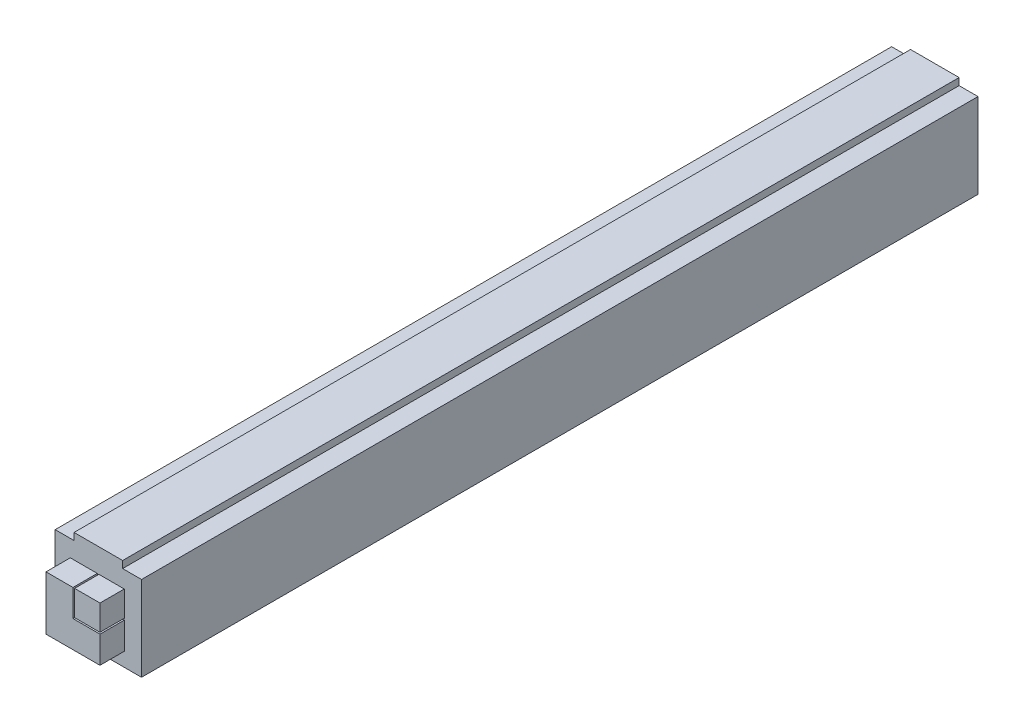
from build123d import *

# Parameters (mm, degrees)
DODANIE_WYCI_GNI_CIE2_START   = -5
DODANIE_WYCI_GNI_CIE2_DEPTH   = 155
DODANIE_WYCI_GNI_CIE3_START   = 0.2
DODANIE_WYCI_GNI_CIE3_DEPTH   = 4.5
SZKIC3_W                      = 4.698607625
SZKIC3_H                      = 4.698607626
DODANIE_WYCI_GNI_CIE3_2_DEPTH = 4.5
SZKIC4_R                      = 6.65
WYTNIJ_WYCI_GNI_CIE1_DEPTH    = 5


with BuildPart() as part:
    # Szkic2 → Dodanie-wyci_gni_cie2 (new body)
    with BuildSketch(Plane.XY.offset(DODANIE_WYCI_GNI_CIE2_START)):
        Polygon((4.5, 29.760650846), (4.5, 28.460650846), (8, 28.460650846), (8, 12.760650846), (-8, 12.760650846), (-8, 28.460650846), (-4.5, 28.460650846), (-4.5, 29.760650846), align=None)
    extrude(amount=-DODANIE_WYCI_GNI_CIE2_DEPTH)

    # Szkic4 → Wytnij-wyci_gni_cie1 (cut)
    with BuildSketch(Plane.XZ.offset(-12.760650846)):
        with Locations(Location((0, -82.4, 0), (0, 0, 270))):
            Circle(SZKIC4_R)
    extrude(amount=-WYTNIJ_WYCI_GNI_CIE1_DEPTH, mode=Mode.SUBTRACT)


with BuildPart() as body_2:
    # Szkic3 → Dodanie-wyci_gni_cie3 (new body)
    with BuildSketch(Plane.XY.offset(-5).offset(DODANIE_WYCI_GNI_CIE3_START)):
        Polygon((0, 25.535408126), (0, 20.535408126), (5, 20.535408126), (5, 15.535408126), (-5, 15.535408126), (-5, 25.535408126), align=None)
    extrude(amount=DODANIE_WYCI_GNI_CIE3_DEPTH)


with BuildPart() as body_3:
    # Szkic3 → Dodanie-wyci_gni_cie3 2 (new body)
    with BuildSketch(Plane.XY.offset(-5).offset(DODANIE_WYCI_GNI_CIE3_START)):
        with Locations((2.650696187, 23.186104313)):
            Rectangle(SZKIC3_W, SZKIC3_H)
    extrude(amount=DODANIE_WYCI_GNI_CIE3_2_DEPTH)


solid = Compound([part.part, body_2.part, body_3.part])
